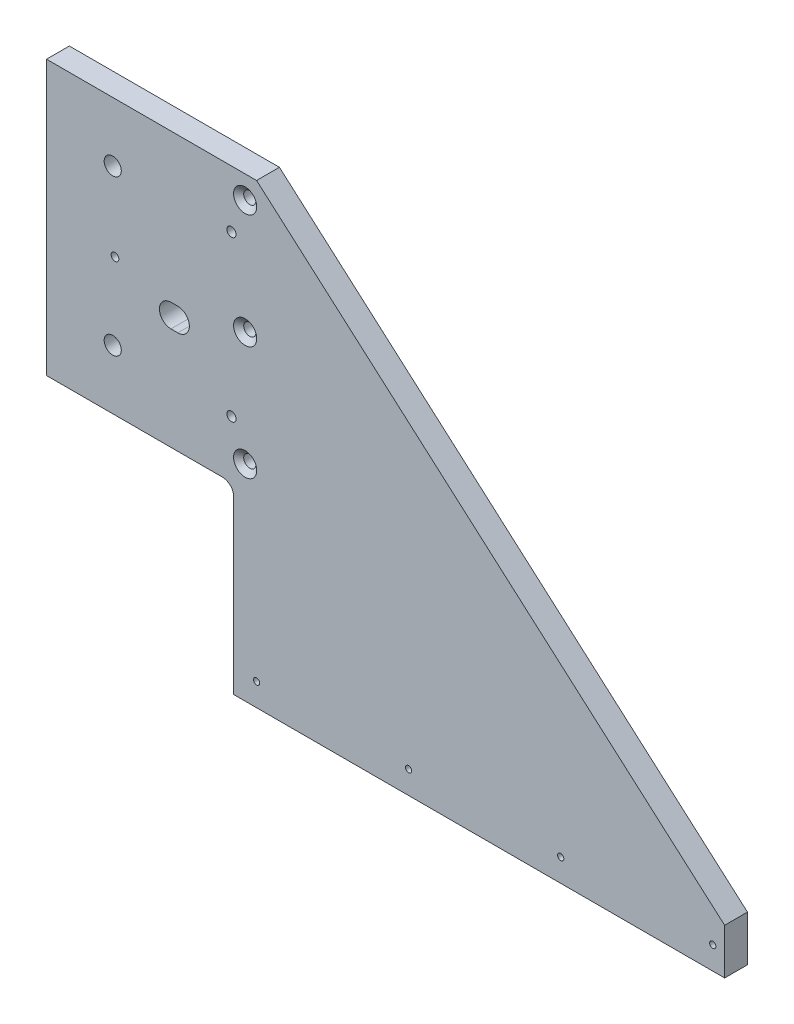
from build123d import *

# Parameters (mm, degrees)
EXTRUDE1_DEPTH                                      = 12.7
SKETCH2_R                                           = 4.7625
CUT_EXTRUDE1_DEPTH                                  = 12.7
CUT_EXTRUDE2_DEPTH                                  = 455.917120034
FILLET1_R                                           = 6.35
F_8_32_TAPPED_HOLE1_D                               = 3.4544
F_1_4_20_TAPPED_HOLE1_D                             = 5.1054
CSK_FOR_1_4_FLAT_HEAD_MACHINE_SCREW_100_D           = 6.7564
CSK_FOR_1_4_FLAT_HEAD_MACHINE_SCREW_100_CSINK_D     = 12.8778
CSK_FOR_1_4_FLAT_HEAD_MACHINE_SCREW_100_CSINK_ANGLE = 100
SKETCH8_R                                           = 2.15265
CUT_EXTRUDE3_DEPTH                                  = 455.917120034


with BuildPart() as part:
    # Sketch1 → Extrude1 (new body)
    with BuildSketch(Plane.XY):
        Polygon((0, 0), (-273.05, 0), (-273.05, 101.6), (-377.19, 101.6), (-377.19, 254), (-260.35, 254), (0, 25.4), align=None)
    extrude(amount=EXTRUDE1_DEPTH)

    # Sketch2 → Cut-Extrude1 (cut)
    with BuildSketch(Plane.XY.offset(12.7)):
        with Locations((-340.36, 220.98)):
            Circle(SKETCH2_R)
        with Locations((-340.36, 134.62)):
            Circle(SKETCH2_R)
    extrude(amount=-CUT_EXTRUDE1_DEPTH, mode=Mode.SUBTRACT)

    # Sketch3 → Cut-Extrude2 (cut, through all)
    with BuildSketch(Plane.XY.offset(12.7)):
        with BuildLine():
            Line((-307.975, 171.5135), (-304.165, 171.5135))
            ThreePointArc((-304.165, 171.5135), (-297.7515, 165.1), (-304.165, 158.6865))
            Line((-304.165, 158.6865), (-307.975, 158.6865))
            ThreePointArc((-307.975, 158.6865), (-314.3885, 165.1), (-307.975, 171.5135))
        make_face()
    extrude(amount=-CUT_EXTRUDE2_DEPTH, mode=Mode.SUBTRACT)

    # Fillet1
    fillet1_edges = [part.edges().sort_by_distance(p)[0] for p in [
        (-273.05, 101.6, 6.35),
    ]]
    fillet(fillet1_edges, radius=FILLET1_R)

    # 8-32 Tapped Hole1 (through all)
    with Locations(Plane(origin=(-260.35, 12.7, 12.7), x_dir=(1, 0, 0), z_dir=(0, 0, 1))):
        with Locations((0, 0), (84.582, 0), (169.164, 0), (253.746, 0)):
            Hole(F_8_32_TAPPED_HOLE1_D / 2)

    # 1_4-20 Tapped Hole1 (through all)
    with Locations(Plane(origin=(-274.32, 222.25, 12.7), x_dir=(1, 0, 0), z_dir=(0, 0, 1))):
        with Locations((0, 0), (0, -88.9)):
            Hole(F_1_4_20_TAPPED_HOLE1_D / 2)

    # CSK for 1_4 Flat Head Machine Screw _100 (through all)
    with Locations(Plane(origin=(-266.7, 241.3, 12.7), x_dir=(1, 0, 0), z_dir=(0, 0, 1))):
        with Locations((0, 0), (0, -63.5), (0, -127)):
            CounterSinkHole(CSK_FOR_1_4_FLAT_HEAD_MACHINE_SCREW_100_D / 2, CSK_FOR_1_4_FLAT_HEAD_MACHINE_SCREW_100_CSINK_D / 2, counter_sink_angle=CSK_FOR_1_4_FLAT_HEAD_MACHINE_SCREW_100_CSINK_ANGLE)

    # Sketch8 → Cut-Extrude3 (cut, through all)
    with BuildSketch(Plane.XY.offset(12.7)):
        with Locations((-339.09, 177.8)):
            Circle(SKETCH8_R)
    extrude(amount=-CUT_EXTRUDE3_DEPTH, mode=Mode.SUBTRACT)


solid = part.part
